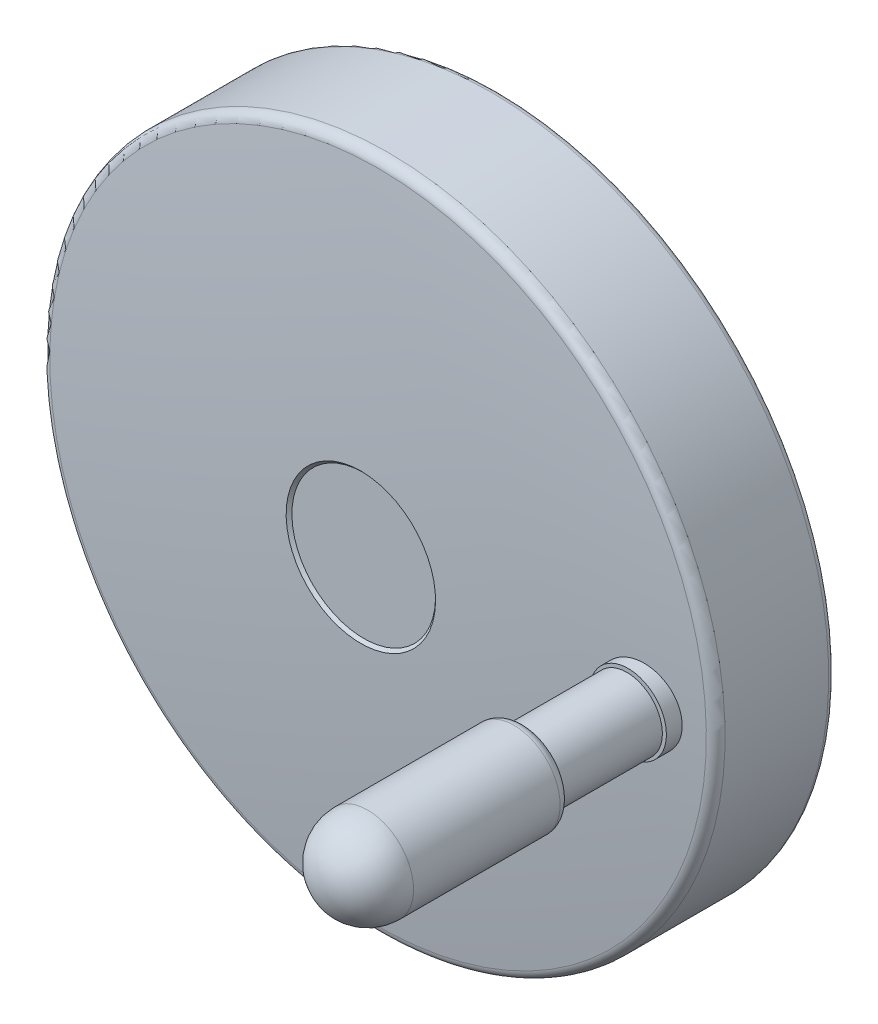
ISO-10303-21;
HEADER;
FILE_DESCRIPTION(('STEP AP214'),'2;1');
FILE_NAME('part.step','',(''),(''),'','','');
FILE_SCHEMA(('AUTOMOTIVE_DESIGN { 1 0 10303 214 1 1 1 1 }'));
ENDSEC;
DATA;
#1=APPLICATION_CONTEXT('core data for automotive mechanical design processes');
#2=APPLICATION_PROTOCOL_DEFINITION('international standard','automotive_design',2000,#1);
#3=PRODUCT_CONTEXT('',#1,'mechanical');
#4=PRODUCT('Part','Part','',(#3));
#5=PRODUCT_RELATED_PRODUCT_CATEGORY('part','',(#4));
#6=PRODUCT_DEFINITION_FORMATION('','',#4);
#7=PRODUCT_DEFINITION_CONTEXT('part definition',#1,'design');
#8=PRODUCT_DEFINITION('design','',#6,#7);
#9=PRODUCT_DEFINITION_SHAPE('','',#8);
#10=(LENGTH_UNIT() NAMED_UNIT(*) SI_UNIT(.MILLI.,.METRE.));
#11=(NAMED_UNIT(*) PLANE_ANGLE_UNIT() SI_UNIT($,.RADIAN.));
#12=(NAMED_UNIT(*) SI_UNIT($,.STERADIAN.) SOLID_ANGLE_UNIT());
#13=UNCERTAINTY_MEASURE_WITH_UNIT(LENGTH_MEASURE(1.E-05),#10,'distance_accuracy_value','');
#14=(GEOMETRIC_REPRESENTATION_CONTEXT(3) GLOBAL_UNCERTAINTY_ASSIGNED_CONTEXT((#13)) GLOBAL_UNIT_ASSIGNED_CONTEXT((#10,
#11,#12)) REPRESENTATION_CONTEXT('',''));
#15=CARTESIAN_POINT('',(0.,0.,0.));
#16=DIRECTION('',(0.,0.,1.));
#17=DIRECTION('',(1.,0.,0.));
#18=AXIS2_PLACEMENT_3D('',#15,#16,#17);
#19=CARTESIAN_POINT('',(70.,0.,117.));
#20=DIRECTION('',(0.,0.,1.));
#21=DIRECTION('',(0.,-1.,0.));
#22=AXIS2_PLACEMENT_3D('',#19,#20,#21);
#23=SPHERICAL_SURFACE('',#22,12.);
#24=CARTESIAN_POINT('',(70.,0.,129.));
#25=VERTEX_POINT('',#24);
#26=VERTEX_LOOP('',#25);
#27=FACE_BOUND('',#26,.T.);
#28=CARTESIAN_POINT('',(70.,0.,117.));
#29=DIRECTION('',(0.,0.,1.));
#30=DIRECTION('',(0.,1.,0.));
#31=AXIS2_PLACEMENT_3D('',#28,#29,#30);
#32=CIRCLE('',#31,12.);
#33=CARTESIAN_POINT('',(70.,12.,117.));
#34=VERTEX_POINT('',#33);
#35=EDGE_CURVE('E246',#34,#34,#32,.F.);
#36=ORIENTED_EDGE('',*,*,#35,.F.);
#37=EDGE_LOOP('',(#36));
#38=FACE_BOUND('',#37,.T.);
#39=ADVANCED_FACE('F14',(#27,#38),#23,.T.);
#40=CARTESIAN_POINT('',(70.,0.,97.875));
#41=DIRECTION('',(0.,0.,1.));
#42=DIRECTION('',(0.,1.,0.));
#43=AXIS2_PLACEMENT_3D('',#40,#41,#42);
#44=CYLINDRICAL_SURFACE('',#43,12.);
#45=ORIENTED_EDGE('',*,*,#35,.T.);
#46=EDGE_LOOP('',(#45));
#47=FACE_BOUND('',#46,.T.);
#48=CARTESIAN_POINT('',(70.,0.,78.75));
#49=DIRECTION('',(0.,0.,1.));
#50=DIRECTION('',(0.,1.,0.));
#51=AXIS2_PLACEMENT_3D('',#48,#49,#50);
#52=CIRCLE('',#51,12.);
#53=CARTESIAN_POINT('',(70.,12.,78.75));
#54=VERTEX_POINT('',#53);
#55=EDGE_CURVE('E26',#54,#54,#52,.T.);
#56=ORIENTED_EDGE('',*,*,#55,.T.);
#57=EDGE_LOOP('',(#56));
#58=FACE_BOUND('',#57,.T.);
#59=ADVANCED_FACE('F227',(#47,#58),#44,.T.);
#60=CARTESIAN_POINT('',(70.,0.,78.75));
#61=DIRECTION('',(0.,0.,-1.));
#62=DIRECTION('',(1.,0.,0.));
#63=AXIS2_PLACEMENT_3D('',#60,#61,#62);
#64=TOROIDAL_SURFACE('',#63,9.24999999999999,2.75);
#65=ORIENTED_EDGE('',*,*,#55,.F.);
#66=EDGE_LOOP('',(#65));
#67=FACE_BOUND('',#66,.T.);
#68=CARTESIAN_POINT('',(70.,0.,76.));
#69=DIRECTION('',(0.,0.,-1.));
#70=DIRECTION('',(1.,0.,0.));
#71=AXIS2_PLACEMENT_3D('',#68,#69,#70);
#72=CIRCLE('',#71,9.25);
#73=CARTESIAN_POINT('',(79.25,0.,76.));
#74=VERTEX_POINT('',#73);
#75=EDGE_CURVE('E249',#74,#74,#72,.F.);
#76=ORIENTED_EDGE('',*,*,#75,.T.);
#77=EDGE_LOOP('',(#76));
#78=FACE_BOUND('',#77,.T.);
#79=ADVANCED_FACE('F233',(#67,#78),#64,.T.);
#80=CARTESIAN_POINT('',(70.,0.,62.65));
#81=DIRECTION('',(0.,0.,1.));
#82=DIRECTION('',(0.,1.,0.));
#83=AXIS2_PLACEMENT_3D('',#80,#81,#82);
#84=CYLINDRICAL_SURFACE('',#83,9.25);
#85=CARTESIAN_POINT('',(70.,0.,49.3));
#86=DIRECTION('',(0.,0.,1.));
#87=DIRECTION('',(0.,1.,0.));
#88=AXIS2_PLACEMENT_3D('',#85,#86,#87);
#89=CIRCLE('',#88,9.25);
#90=CARTESIAN_POINT('',(70.,9.24999999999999,49.3));
#91=VERTEX_POINT('',#90);
#92=EDGE_CURVE('E254',#91,#91,#89,.T.);
#93=ORIENTED_EDGE('',*,*,#92,.T.);
#94=EDGE_LOOP('',(#93));
#95=FACE_BOUND('',#94,.T.);
#96=ORIENTED_EDGE('',*,*,#75,.F.);
#97=EDGE_LOOP('',(#96));
#98=FACE_BOUND('',#97,.T.);
#99=ADVANCED_FACE('F241',(#95,#98),#84,.T.);
#100=CARTESIAN_POINT('',(70.,-8.09375,49.3));
#101=DIRECTION('',(0.,0.,-1.));
#102=DIRECTION('',(0.,-1.,0.));
#103=AXIS2_PLACEMENT_3D('',#100,#101,#102);
#104=PLANE('',#103);
#105=ORIENTED_EDGE('',*,*,#92,.F.);
#106=EDGE_LOOP('',(#105));
#107=FACE_BOUND('',#106,.T.);
#108=CARTESIAN_POINT('',(70.,0.,49.3));
#109=DIRECTION('',(0.,0.,1.));
#110=DIRECTION('',(0.,1.,0.));
#111=AXIS2_PLACEMENT_3D('',#108,#109,#110);
#112=CIRCLE('',#111,6.9375);
#113=CARTESIAN_POINT('',(70.,6.93749999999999,49.3));
#114=VERTEX_POINT('',#113);
#115=EDGE_CURVE('E324',#114,#114,#112,.T.);
#116=ORIENTED_EDGE('',*,*,#115,.T.);
#117=EDGE_LOOP('',(#116));
#118=FACE_BOUND('',#117,.T.);
#119=ADVANCED_FACE('F590',(#107,#118),#104,.T.);
#120=CARTESIAN_POINT('',(70.,0.,49.15));
#121=DIRECTION('',(0.,0.,1.));
#122=DIRECTION('',(0.,1.,0.));
#123=AXIS2_PLACEMENT_3D('',#120,#121,#122);
#124=CYLINDRICAL_SURFACE('',#123,6.9375);
#125=CARTESIAN_POINT('',(70.,0.,49.));
#126=DIRECTION('',(0.,0.,1.));
#127=DIRECTION('',(0.,1.,0.));
#128=AXIS2_PLACEMENT_3D('',#125,#126,#127);
#129=CIRCLE('',#128,6.9375);
#130=CARTESIAN_POINT('',(70.,6.93749999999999,49.));
#131=VERTEX_POINT('',#130);
#132=EDGE_CURVE('E327',#131,#131,#129,.T.);
#133=ORIENTED_EDGE('',*,*,#132,.T.);
#134=EDGE_LOOP('',(#133));
#135=FACE_BOUND('',#134,.T.);
#136=ORIENTED_EDGE('',*,*,#115,.F.);
#137=EDGE_LOOP('',(#136));
#138=FACE_BOUND('',#137,.T.);
#139=ADVANCED_FACE('F346',(#135,#138),#124,.T.);
#140=CARTESIAN_POINT('',(70.,-5.08525,49.));
#141=DIRECTION('',(0.,0.,-1.));
#142=DIRECTION('',(0.,-1.,0.));
#143=AXIS2_PLACEMENT_3D('',#140,#141,#142);
#144=PLANE('',#143);
#145=CARTESIAN_POINT('',(70.,0.,49.));
#146=DIRECTION('',(0.,0.,1.));
#147=DIRECTION('',(0.,1.,0.));
#148=AXIS2_PLACEMENT_3D('',#145,#146,#147);
#149=CIRCLE('',#148,3.233);
#150=CARTESIAN_POINT('',(70.,3.23299999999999,49.));
#151=VERTEX_POINT('',#150);
#152=EDGE_CURVE('E260',#151,#151,#149,.T.);
#153=ORIENTED_EDGE('',*,*,#152,.T.);
#154=EDGE_LOOP('',(#153));
#155=FACE_BOUND('',#154,.T.);
#156=CARTESIAN_POINT('',(70.,0.,49.));
#157=DIRECTION('',(0.,0.,-1.));
#158=DIRECTION('',(0.,-1.,0.));
#159=AXIS2_PLACEMENT_3D('',#156,#157,#158);
#160=CIRCLE('',#159,5.00000000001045);
#161=CARTESIAN_POINT('',(70.,-5.00000000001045,49.));
#162=VERTEX_POINT('',#161);
#163=EDGE_CURVE('E9',#162,#162,#160,.T.);
#164=ORIENTED_EDGE('',*,*,#163,.T.);
#165=EDGE_LOOP('',(#164));
#166=FACE_BOUND('',#165,.T.);
#167=ADVANCED_FACE('F223',(#155,#166),#144,.T.);
#168=CARTESIAN_POINT('',(70.,0.,38.));
#169=DIRECTION('',(0.,0.,1.));
#170=DIRECTION('',(0.,1.,0.));
#171=AXIS2_PLACEMENT_3D('',#168,#169,#170);
#172=PLANE('',#171);
#173=DIRECTION('',(0.866025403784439,-0.5,0.));
#174=VECTOR('',#173,1.);
#175=CARTESIAN_POINT('',(70.,-2.30940107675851,38.));
#176=LINE('',#175,#174);
#177=CARTESIAN_POINT('',(70.,-2.30940107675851,38.));
#178=VERTEX_POINT('',#177);
#179=CARTESIAN_POINT('',(68.,-1.15470053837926,38.));
#180=VERTEX_POINT('',#179);
#181=EDGE_CURVE('E286',#178,#180,#176,.F.);
#182=ORIENTED_EDGE('',*,*,#181,.T.);
#183=DIRECTION('',(0.,-1.,0.));
#184=VECTOR('',#183,1.);
#185=CARTESIAN_POINT('',(68.,-1.15470053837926,38.));
#186=LINE('',#185,#184);
#187=CARTESIAN_POINT('',(68.,1.15470053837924,38.));
#188=VERTEX_POINT('',#187);
#189=EDGE_CURVE('E294',#180,#188,#186,.F.);
#190=ORIENTED_EDGE('',*,*,#189,.T.);
#191=DIRECTION('',(-0.866025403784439,-0.5,0.));
#192=VECTOR('',#191,1.);
#193=CARTESIAN_POINT('',(68.,1.15470053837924,38.));
#194=LINE('',#193,#192);
#195=CARTESIAN_POINT('',(70.,2.30940107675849,38.));
#196=VERTEX_POINT('',#195);
#197=EDGE_CURVE('E300',#188,#196,#194,.F.);
#198=ORIENTED_EDGE('',*,*,#197,.T.);
#199=DIRECTION('',(-0.866025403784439,0.5,0.));
#200=VECTOR('',#199,1.);
#201=CARTESIAN_POINT('',(70.,2.30940107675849,38.));
#202=LINE('',#201,#200);
#203=CARTESIAN_POINT('',(72.,1.15470053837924,38.));
#204=VERTEX_POINT('',#203);
#205=EDGE_CURVE('E306',#196,#204,#202,.F.);
#206=ORIENTED_EDGE('',*,*,#205,.T.);
#207=DIRECTION('',(0.,1.,0.));
#208=VECTOR('',#207,1.);
#209=CARTESIAN_POINT('',(72.,1.15470053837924,38.));
#210=LINE('',#209,#208);
#211=CARTESIAN_POINT('',(72.,-1.15470053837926,38.));
#212=VERTEX_POINT('',#211);
#213=EDGE_CURVE('E312',#204,#212,#210,.F.);
#214=ORIENTED_EDGE('',*,*,#213,.T.);
#215=DIRECTION('',(0.866025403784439,0.5,0.));
#216=VECTOR('',#215,1.);
#217=CARTESIAN_POINT('',(72.,-1.15470053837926,38.));
#218=LINE('',#217,#216);
#219=EDGE_CURVE('E318',#212,#178,#218,.F.);
#220=ORIENTED_EDGE('',*,*,#219,.T.);
#221=EDGE_LOOP('',(#182,#190,#198,#206,#214,#220));
#222=FACE_BOUND('',#221,.T.);
#223=ADVANCED_FACE('F347',(#222),#172,.F.);
#224=CARTESIAN_POINT('',(72.,-1.15470053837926,34.));
#225=DIRECTION('',(0.5,-0.866025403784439,0.));
#226=DIRECTION('',(0.866025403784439,0.5,0.));
#227=AXIS2_PLACEMENT_3D('',#224,#225,#226);
#228=PLANE('',#227);
#229=DIRECTION('',(0.,0.,1.));
#230=VECTOR('',#229,1.);
#231=CARTESIAN_POINT('',(72.,-1.15470053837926,34.));
#232=LINE('',#231,#230);
#233=CARTESIAN_POINT('',(72.,-1.15470053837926,34.));
#234=VERTEX_POINT('',#233);
#235=EDGE_CURVE('E315',#212,#234,#232,.F.);
#236=ORIENTED_EDGE('',*,*,#235,.T.);
#237=DIRECTION('',(0.866025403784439,0.5,0.));
#238=VECTOR('',#237,1.);
#239=CARTESIAN_POINT('',(70.,-2.30940107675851,34.));
#240=LINE('',#239,#238);
#241=CARTESIAN_POINT('',(70.,-2.30940107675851,34.));
#242=VERTEX_POINT('',#241);
#243=EDGE_CURVE('E283',#242,#234,#240,.T.);
#244=ORIENTED_EDGE('',*,*,#243,.F.);
#245=DIRECTION('',(0.,0.,1.));
#246=VECTOR('',#245,1.);
#247=CARTESIAN_POINT('',(70.,-2.30940107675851,34.));
#248=LINE('',#247,#246);
#249=EDGE_CURVE('E289',#242,#178,#248,.T.);
#250=ORIENTED_EDGE('',*,*,#249,.T.);
#251=ORIENTED_EDGE('',*,*,#219,.F.);
#252=EDGE_LOOP('',(#236,#244,#250,#251));
#253=FACE_BOUND('',#252,.T.);
#254=ADVANCED_FACE('F581',(#253),#228,.F.);
#255=CARTESIAN_POINT('',(72.,1.15470053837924,34.));
#256=DIRECTION('',(1.,0.,0.));
#257=DIRECTION('',(0.,1.,0.));
#258=AXIS2_PLACEMENT_3D('',#255,#256,#257);
#259=PLANE('',#258);
#260=DIRECTION('',(0.,0.,1.));
#261=VECTOR('',#260,1.);
#262=CARTESIAN_POINT('',(72.,1.15470053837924,34.));
#263=LINE('',#262,#261);
#264=CARTESIAN_POINT('',(72.,1.15470053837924,34.));
#265=VERTEX_POINT('',#264);
#266=EDGE_CURVE('E309',#204,#265,#263,.F.);
#267=ORIENTED_EDGE('',*,*,#266,.T.);
#268=DIRECTION('',(0.,-1.,0.));
#269=VECTOR('',#268,1.);
#270=CARTESIAN_POINT('',(72.,-1.6165,34.));
#271=LINE('',#270,#269);
#272=EDGE_CURVE('E280',#234,#265,#271,.F.);
#273=ORIENTED_EDGE('',*,*,#272,.F.);
#274=ORIENTED_EDGE('',*,*,#235,.F.);
#275=ORIENTED_EDGE('',*,*,#213,.F.);
#276=EDGE_LOOP('',(#267,#273,#274,#275));
#277=FACE_BOUND('',#276,.T.);
#278=ADVANCED_FACE('F683',(#277),#259,.F.);
#279=CARTESIAN_POINT('',(70.,2.30940107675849,34.));
#280=DIRECTION('',(0.5,0.866025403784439,0.));
#281=DIRECTION('',(-0.866025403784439,0.5,0.));
#282=AXIS2_PLACEMENT_3D('',#279,#280,#281);
#283=PLANE('',#282);
#284=DIRECTION('',(0.,0.,1.));
#285=VECTOR('',#284,1.);
#286=CARTESIAN_POINT('',(70.,2.30940107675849,34.));
#287=LINE('',#286,#285);
#288=CARTESIAN_POINT('',(70.,2.30940107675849,34.));
#289=VERTEX_POINT('',#288);
#290=EDGE_CURVE('E303',#196,#289,#287,.F.);
#291=ORIENTED_EDGE('',*,*,#290,.T.);
#292=DIRECTION('',(-0.866025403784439,0.5,0.));
#293=VECTOR('',#292,1.);
#294=CARTESIAN_POINT('',(72.,1.15470053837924,34.));
#295=LINE('',#294,#293);
#296=EDGE_CURVE('E277',#265,#289,#295,.T.);
#297=ORIENTED_EDGE('',*,*,#296,.F.);
#298=ORIENTED_EDGE('',*,*,#266,.F.);
#299=ORIENTED_EDGE('',*,*,#205,.F.);
#300=EDGE_LOOP('',(#291,#297,#298,#299));
#301=FACE_BOUND('',#300,.T.);
#302=ADVANCED_FACE('F673',(#301),#283,.F.);
#303=CARTESIAN_POINT('',(68.,1.15470053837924,34.));
#304=DIRECTION('',(-0.5,0.866025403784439,0.));
#305=DIRECTION('',(-0.866025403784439,-0.5,0.));
#306=AXIS2_PLACEMENT_3D('',#303,#304,#305);
#307=PLANE('',#306);
#308=DIRECTION('',(0.,0.,1.));
#309=VECTOR('',#308,1.);
#310=CARTESIAN_POINT('',(68.,1.15470053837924,34.));
#311=LINE('',#310,#309);
#312=CARTESIAN_POINT('',(68.,1.15470053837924,34.));
#313=VERTEX_POINT('',#312);
#314=EDGE_CURVE('E297',#188,#313,#311,.F.);
#315=ORIENTED_EDGE('',*,*,#314,.T.);
#316=DIRECTION('',(-0.866025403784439,-0.5,0.));
#317=VECTOR('',#316,1.);
#318=CARTESIAN_POINT('',(70.,2.30940107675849,34.));
#319=LINE('',#318,#317);
#320=EDGE_CURVE('E274',#289,#313,#319,.T.);
#321=ORIENTED_EDGE('',*,*,#320,.F.);
#322=ORIENTED_EDGE('',*,*,#290,.F.);
#323=ORIENTED_EDGE('',*,*,#197,.F.);
#324=EDGE_LOOP('',(#315,#321,#322,#323));
#325=FACE_BOUND('',#324,.T.);
#326=ADVANCED_FACE('F663',(#325),#307,.F.);
#327=CARTESIAN_POINT('',(68.,-1.15470053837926,34.));
#328=DIRECTION('',(-1.,0.,0.));
#329=DIRECTION('',(0.,-1.,0.));
#330=AXIS2_PLACEMENT_3D('',#327,#328,#329);
#331=PLANE('',#330);
#332=DIRECTION('',(0.,0.,1.));
#333=VECTOR('',#332,1.);
#334=CARTESIAN_POINT('',(68.,-1.15470053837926,34.));
#335=LINE('',#334,#333);
#336=CARTESIAN_POINT('',(68.,-1.15470053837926,34.));
#337=VERTEX_POINT('',#336);
#338=EDGE_CURVE('E292',#180,#337,#335,.F.);
#339=ORIENTED_EDGE('',*,*,#338,.T.);
#340=DIRECTION('',(0.,-1.,0.));
#341=VECTOR('',#340,1.);
#342=CARTESIAN_POINT('',(68.,-1.6165,34.));
#343=LINE('',#342,#341);
#344=EDGE_CURVE('E271',#313,#337,#343,.T.);
#345=ORIENTED_EDGE('',*,*,#344,.F.);
#346=ORIENTED_EDGE('',*,*,#314,.F.);
#347=ORIENTED_EDGE('',*,*,#189,.F.);
#348=EDGE_LOOP('',(#339,#345,#346,#347));
#349=FACE_BOUND('',#348,.T.);
#350=ADVANCED_FACE('F653',(#349),#331,.F.);
#351=CARTESIAN_POINT('',(70.,-2.30940107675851,34.));
#352=DIRECTION('',(-0.5,-0.866025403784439,0.));
#353=DIRECTION('',(0.866025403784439,-0.5,0.));
#354=AXIS2_PLACEMENT_3D('',#351,#352,#353);
#355=PLANE('',#354);
#356=ORIENTED_EDGE('',*,*,#249,.F.);
#357=DIRECTION('',(0.866025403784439,-0.5,0.));
#358=VECTOR('',#357,1.);
#359=CARTESIAN_POINT('',(68.,-1.15470053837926,34.));
#360=LINE('',#359,#358);
#361=EDGE_CURVE('E268',#337,#242,#360,.T.);
#362=ORIENTED_EDGE('',*,*,#361,.F.);
#363=ORIENTED_EDGE('',*,*,#338,.F.);
#364=ORIENTED_EDGE('',*,*,#181,.F.);
#365=EDGE_LOOP('',(#356,#362,#363,#364));
#366=FACE_BOUND('',#365,.T.);
#367=ADVANCED_FACE('F643',(#366),#355,.F.);
#368=CARTESIAN_POINT('',(70.,-1.6165,34.));
#369=DIRECTION('',(0.,0.,-1.));
#370=DIRECTION('',(0.,-1.,0.));
#371=AXIS2_PLACEMENT_3D('',#368,#369,#370);
#372=PLANE('',#371);
#373=CARTESIAN_POINT('',(70.,0.,33.9999999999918));
#374=DIRECTION('',(0.,0.,1.));
#375=DIRECTION('',(0.,1.,0.));
#376=AXIS2_PLACEMENT_3D('',#373,#374,#375);
#377=CIRCLE('',#376,3.23299999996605);
#378=CARTESIAN_POINT('',(70.,3.23299999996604,33.9999999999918));
#379=VERTEX_POINT('',#378);
#380=EDGE_CURVE('E267',#379,#379,#377,.T.);
#381=ORIENTED_EDGE('',*,*,#380,.F.);
#382=EDGE_LOOP('',(#381));
#383=FACE_BOUND('',#382,.T.);
#384=ORIENTED_EDGE('',*,*,#344,.T.);
#385=ORIENTED_EDGE('',*,*,#361,.T.);
#386=ORIENTED_EDGE('',*,*,#243,.T.);
#387=ORIENTED_EDGE('',*,*,#272,.T.);
#388=ORIENTED_EDGE('',*,*,#296,.T.);
#389=ORIENTED_EDGE('',*,*,#320,.T.);
#390=EDGE_LOOP('',(#384,#385,#386,#387,#388,#389));
#391=FACE_BOUND('',#390,.T.);
#392=ADVANCED_FACE('F633',(#383,#391),#372,.T.);
#393=CARTESIAN_POINT('',(70.,0.,34.766999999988));
#394=DIRECTION('',(0.,0.,1.));
#395=DIRECTION('',(0.,1.,0.));
#396=AXIS2_PLACEMENT_3D('',#393,#394,#395);
#397=CONICAL_SURFACE('',#396,3.99999999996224,0.785398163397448);
#398=ORIENTED_EDGE('',*,*,#380,.T.);
#399=EDGE_LOOP('',(#398));
#400=FACE_BOUND('',#399,.T.);
#401=CARTESIAN_POINT('',(70.,0.,34.767));
#402=DIRECTION('',(0.,0.,1.));
#403=DIRECTION('',(0.,1.,0.));
#404=AXIS2_PLACEMENT_3D('',#401,#402,#403);
#405=CIRCLE('',#404,4.);
#406=CARTESIAN_POINT('',(70.,3.99999999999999,34.767));
#407=VERTEX_POINT('',#406);
#408=EDGE_CURVE('E264',#407,#407,#405,.T.);
#409=ORIENTED_EDGE('',*,*,#408,.F.);
#410=EDGE_LOOP('',(#409));
#411=FACE_BOUND('',#410,.T.);
#412=ADVANCED_FACE('F623',(#400,#411),#397,.T.);
#413=CARTESIAN_POINT('',(70.,0.,40.75));
#414=DIRECTION('',(0.,0.,1.));
#415=DIRECTION('',(0.,1.,0.));
#416=AXIS2_PLACEMENT_3D('',#413,#414,#415);
#417=CYLINDRICAL_SURFACE('',#416,4.);
#418=ORIENTED_EDGE('',*,*,#408,.T.);
#419=EDGE_LOOP('',(#418));
#420=FACE_BOUND('',#419,.T.);
#421=CARTESIAN_POINT('',(70.,0.,46.7330000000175));
#422=DIRECTION('',(0.,0.,-1.));
#423=DIRECTION('',(0.,-1.,0.));
#424=AXIS2_PLACEMENT_3D('',#421,#422,#423);
#425=CIRCLE('',#424,4.00000000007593);
#426=CARTESIAN_POINT('',(70.,-4.00000000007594,46.7330000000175));
#427=VERTEX_POINT('',#426);
#428=EDGE_CURVE('E261',#427,#427,#425,.F.);
#429=ORIENTED_EDGE('',*,*,#428,.F.);
#430=EDGE_LOOP('',(#429));
#431=FACE_BOUND('',#430,.T.);
#432=ADVANCED_FACE('F613',(#420,#431),#417,.T.);
#433=CARTESIAN_POINT('',(70.,0.,46.7330000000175));
#434=DIRECTION('',(0.,0.,-1.));
#435=DIRECTION('',(0.,-1.,0.));
#436=AXIS2_PLACEMENT_3D('',#433,#434,#435);
#437=CONICAL_SURFACE('',#436,4.00000000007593,0.785398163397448);
#438=ORIENTED_EDGE('',*,*,#428,.T.);
#439=EDGE_LOOP('',(#438));
#440=FACE_BOUND('',#439,.T.);
#441=CARTESIAN_POINT('',(70.,0.,47.5));
#442=DIRECTION('',(0.,0.,1.));
#443=DIRECTION('',(0.,1.,0.));
#444=AXIS2_PLACEMENT_3D('',#441,#442,#443);
#445=CIRCLE('',#444,3.233);
#446=CARTESIAN_POINT('',(70.,3.23299999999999,47.5));
#447=VERTEX_POINT('',#446);
#448=EDGE_CURVE('E257',#447,#447,#445,.T.);
#449=ORIENTED_EDGE('',*,*,#448,.F.);
#450=EDGE_LOOP('',(#449));
#451=FACE_BOUND('',#450,.T.);
#452=ADVANCED_FACE('F602',(#440,#451),#437,.T.);
#453=CARTESIAN_POINT('',(70.,0.,48.25));
#454=DIRECTION('',(0.,0.,1.));
#455=DIRECTION('',(0.,1.,0.));
#456=AXIS2_PLACEMENT_3D('',#453,#454,#455);
#457=CYLINDRICAL_SURFACE('',#456,3.233);
#458=ORIENTED_EDGE('',*,*,#448,.T.);
#459=EDGE_LOOP('',(#458));
#460=FACE_BOUND('',#459,.T.);
#461=ORIENTED_EDGE('',*,*,#152,.F.);
#462=EDGE_LOOP('',(#461));
#463=FACE_BOUND('',#462,.T.);
#464=ADVANCED_FACE('F221',(#460,#463),#457,.T.);
#465=CARTESIAN_POINT('',(-8.25,0.,30.8));
#466=DIRECTION('',(0.,0.,-1.));
#467=DIRECTION('',(-1.,0.,0.));
#468=AXIS2_PLACEMENT_3D('',#465,#466,#467);
#469=PLANE('',#468);
#470=CARTESIAN_POINT('',(0.,0.,30.8));
#471=DIRECTION('',(0.,0.,-1.));
#472=DIRECTION('',(0.,-1.,0.));
#473=AXIS2_PLACEMENT_3D('',#470,#471,#472);
#474=CIRCLE('',#473,16.5);
#475=CARTESIAN_POINT('',(0.,-16.5,30.8));
#476=VERTEX_POINT('',#475);
#477=EDGE_CURVE('E434',#476,#476,#474,.T.);
#478=ORIENTED_EDGE('',*,*,#477,.T.);
#479=EDGE_LOOP('',(#478));
#480=FACE_BOUND('',#479,.T.);
#481=ADVANCED_FACE('F16',(#480),#469,.T.);
#482=CARTESIAN_POINT('',(0.,0.,29.4));
#483=DIRECTION('',(0.,0.,-1.));
#484=DIRECTION('',(0.,-1.,0.));
#485=AXIS2_PLACEMENT_3D('',#482,#483,#484);
#486=CYLINDRICAL_SURFACE('',#485,16.5);
#487=CARTESIAN_POINT('',(0.,0.,28.));
#488=DIRECTION('',(0.,0.,-1.));
#489=DIRECTION('',(0.,-1.,0.));
#490=AXIS2_PLACEMENT_3D('',#487,#488,#489);
#491=CIRCLE('',#490,16.5);
#492=CARTESIAN_POINT('',(0.,-16.5,28.));
#493=VERTEX_POINT('',#492);
#494=EDGE_CURVE('E431',#493,#493,#491,.F.);
#495=ORIENTED_EDGE('',*,*,#494,.F.);
#496=EDGE_LOOP('',(#495));
#497=FACE_BOUND('',#496,.T.);
#498=ORIENTED_EDGE('',*,*,#477,.F.);
#499=EDGE_LOOP('',(#498));
#500=FACE_BOUND('',#499,.T.);
#501=ADVANCED_FACE('F212',(#497,#500),#486,.F.);
#502=CARTESIAN_POINT('',(-12.5166666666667,0.,28.));
#503=DIRECTION('',(0.,0.,1.));
#504=DIRECTION('',(0.,1.,0.));
#505=AXIS2_PLACEMENT_3D('',#502,#503,#504);
#506=PLANE('',#505);
#507=ORIENTED_EDGE('',*,*,#494,.T.);
#508=EDGE_LOOP('',(#507));
#509=FACE_BOUND('',#508,.T.);
#510=CARTESIAN_POINT('',(0.,0.,28.));
#511=DIRECTION('',(0.,0.,1.));
#512=DIRECTION('',(0.,1.,0.));
#513=AXIS2_PLACEMENT_3D('',#510,#511,#512);
#514=CIRCLE('',#513,8.53333333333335);
#515=CARTESIAN_POINT('',(0.,8.53333333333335,28.));
#516=VERTEX_POINT('',#515);
#517=EDGE_CURVE('E427',#516,#516,#514,.F.);
#518=ORIENTED_EDGE('',*,*,#517,.T.);
#519=EDGE_LOOP('',(#518));
#520=FACE_BOUND('',#519,.T.);
#521=ADVANCED_FACE('F209',(#509,#520),#506,.T.);
#522=CARTESIAN_POINT('',(0.,0.,28.));
#523=DIRECTION('',(0.,0.,1.));
#524=DIRECTION('',(0.,1.,0.));
#525=AXIS2_PLACEMENT_3D('',#522,#523,#524);
#526=CONICAL_SURFACE('',#525,8.53333333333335,0.785398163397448);
#527=CARTESIAN_POINT('',(0.,0.,27.4666666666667));
#528=DIRECTION('',(0.,0.,-1.));
#529=DIRECTION('',(0.,-1.,0.));
#530=AXIS2_PLACEMENT_3D('',#527,#528,#529);
#531=CIRCLE('',#530,8.);
#532=CARTESIAN_POINT('',(0.,-8.,27.4666666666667));
#533=VERTEX_POINT('',#532);
#534=EDGE_CURVE('E430',#533,#533,#531,.T.);
#535=ORIENTED_EDGE('',*,*,#534,.T.);
#536=EDGE_LOOP('',(#535));
#537=FACE_BOUND('',#536,.T.);
#538=ORIENTED_EDGE('',*,*,#517,.F.);
#539=EDGE_LOOP('',(#538));
#540=FACE_BOUND('',#539,.T.);
#541=ADVANCED_FACE('F205',(#537,#540),#526,.F.);
#542=CARTESIAN_POINT('',(0.,0.,14.));
#543=DIRECTION('',(0.,0.,-1.));
#544=DIRECTION('',(0.,-1.,0.));
#545=AXIS2_PLACEMENT_3D('',#542,#543,#544);
#546=CYLINDRICAL_SURFACE('',#545,8.);
#547=CARTESIAN_POINT('',(0.,0.,0.533333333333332));
#548=DIRECTION('',(0.,0.,-1.));
#549=DIRECTION('',(-1.,0.,0.));
#550=AXIS2_PLACEMENT_3D('',#547,#548,#549);
#551=CIRCLE('',#550,8.);
#552=CARTESIAN_POINT('',(-8.,0.,0.533333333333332));
#553=VERTEX_POINT('',#552);
#554=EDGE_CURVE('E426',#553,#553,#551,.T.);
#555=ORIENTED_EDGE('',*,*,#554,.T.);
#556=EDGE_LOOP('',(#555));
#557=FACE_BOUND('',#556,.T.);
#558=ORIENTED_EDGE('',*,*,#534,.F.);
#559=EDGE_LOOP('',(#558));
#560=FACE_BOUND('',#559,.T.);
#561=ADVANCED_FACE('F201',(#557,#560),#546,.F.);
#562=CARTESIAN_POINT('',(0.,0.,0.));
#563=DIRECTION('',(0.,0.,-1.));
#564=DIRECTION('',(0.,-1.,0.));
#565=AXIS2_PLACEMENT_3D('',#562,#563,#564);
#566=CONICAL_SURFACE('',#565,8.53333333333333,0.78539816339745);
#567=CARTESIAN_POINT('',(0.,0.,0.));
#568=DIRECTION('',(0.,0.,-1.));
#569=DIRECTION('',(0.,-1.,0.));
#570=AXIS2_PLACEMENT_3D('',#567,#568,#569);
#571=CIRCLE('',#570,8.53333333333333);
#572=CARTESIAN_POINT('',(0.,-8.53333333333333,0.));
#573=VERTEX_POINT('',#572);
#574=EDGE_CURVE('E423',#573,#573,#571,.F.);
#575=ORIENTED_EDGE('',*,*,#574,.F.);
#576=EDGE_LOOP('',(#575));
#577=FACE_BOUND('',#576,.T.);
#578=ORIENTED_EDGE('',*,*,#554,.F.);
#579=EDGE_LOOP('',(#578));
#580=FACE_BOUND('',#579,.T.);
#581=ADVANCED_FACE('F197',(#577,#580),#566,.F.);
#582=CARTESIAN_POINT('',(-13.0166666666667,0.,0.));
#583=DIRECTION('',(0.,0.,-1.));
#584=DIRECTION('',(0.,-1.,0.));
#585=AXIS2_PLACEMENT_3D('',#582,#583,#584);
#586=PLANE('',#585);
#587=ORIENTED_EDGE('',*,*,#574,.T.);
#588=EDGE_LOOP('',(#587));
#589=FACE_BOUND('',#588,.T.);
#590=CARTESIAN_POINT('',(0.,0.,0.));
#591=DIRECTION('',(0.,0.,-1.));
#592=DIRECTION('',(0.,-1.,0.));
#593=AXIS2_PLACEMENT_3D('',#590,#591,#592);
#594=CIRCLE('',#593,17.5);
#595=CARTESIAN_POINT('',(0.,-17.5,0.));
#596=VERTEX_POINT('',#595);
#597=EDGE_CURVE('E420',#596,#596,#594,.F.);
#598=ORIENTED_EDGE('',*,*,#597,.F.);
#599=EDGE_LOOP('',(#598));
#600=FACE_BOUND('',#599,.T.);
#601=ADVANCED_FACE('F193',(#589,#600),#586,.T.);
#602=CARTESIAN_POINT('',(0.,0.,0.1));
#603=DIRECTION('',(0.,0.,-1.));
#604=DIRECTION('',(0.,-1.,0.));
#605=AXIS2_PLACEMENT_3D('',#602,#603,#604);
#606=CYLINDRICAL_SURFACE('',#605,17.5);
#607=CARTESIAN_POINT('',(0.,0.,0.2));
#608=DIRECTION('',(0.,0.,-1.));
#609=DIRECTION('',(0.,-1.,0.));
#610=AXIS2_PLACEMENT_3D('',#607,#608,#609);
#611=CIRCLE('',#610,17.5);
#612=CARTESIAN_POINT('',(0.,-17.5,0.2));
#613=VERTEX_POINT('',#612);
#614=EDGE_CURVE('E417',#613,#613,#611,.F.);
#615=ORIENTED_EDGE('',*,*,#614,.F.);
#616=EDGE_LOOP('',(#615));
#617=FACE_BOUND('',#616,.T.);
#618=ORIENTED_EDGE('',*,*,#597,.T.);
#619=EDGE_LOOP('',(#618));
#620=FACE_BOUND('',#619,.T.);
#621=ADVANCED_FACE('F189',(#617,#620),#606,.T.);
#622=CARTESIAN_POINT('',(-19.75,0.,0.2));
#623=DIRECTION('',(0.,0.,-1.));
#624=DIRECTION('',(-1.,0.,0.));
#625=AXIS2_PLACEMENT_3D('',#622,#623,#624);
#626=PLANE('',#625);
#627=ORIENTED_EDGE('',*,*,#614,.T.);
#628=EDGE_LOOP('',(#627));
#629=FACE_BOUND('',#628,.T.);
#630=CARTESIAN_POINT('',(0.,0.,0.2));
#631=DIRECTION('',(0.,0.,-1.));
#632=DIRECTION('',(0.,-1.,0.));
#633=AXIS2_PLACEMENT_3D('',#630,#631,#632);
#634=CIRCLE('',#633,22.);
#635=CARTESIAN_POINT('',(0.,-22.,0.2));
#636=VERTEX_POINT('',#635);
#637=EDGE_CURVE('E414',#636,#636,#634,.F.);
#638=ORIENTED_EDGE('',*,*,#637,.F.);
#639=EDGE_LOOP('',(#638));
#640=FACE_BOUND('',#639,.T.);
#641=ADVANCED_FACE('F185',(#629,#640),#626,.T.);
#642=CARTESIAN_POINT('',(0.,0.,14.5934787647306));
#643=DIRECTION('',(0.,0.,-1.));
#644=DIRECTION('',(0.,-1.,0.));
#645=AXIS2_PLACEMENT_3D('',#642,#643,#644);
#646=CYLINDRICAL_SURFACE('',#645,22.);
#647=ORIENTED_EDGE('',*,*,#637,.T.);
#648=EDGE_LOOP('',(#647));
#649=FACE_BOUND('',#648,.T.);
#650=CARTESIAN_POINT('',(0.,0.,28.9869575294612));
#651=DIRECTION('',(0.,0.,1.));
#652=DIRECTION('',(0.,1.,0.));
#653=AXIS2_PLACEMENT_3D('',#650,#651,#652);
#654=CIRCLE('',#653,22.);
#655=CARTESIAN_POINT('',(0.,22.,28.9869575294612));
#656=VERTEX_POINT('',#655);
#657=EDGE_CURVE('E174',#656,#656,#654,.F.);
#658=ORIENTED_EDGE('',*,*,#657,.T.);
#659=EDGE_LOOP('',(#658));
#660=FACE_BOUND('',#659,.T.);
#661=ADVANCED_FACE('F181',(#649,#660),#646,.T.);
#662=CARTESIAN_POINT('',(0.,0.,28.9869575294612));
#663=DIRECTION('',(0.,0.,1.));
#664=DIRECTION('',(0.,1.,0.));
#665=AXIS2_PLACEMENT_3D('',#662,#663,#664);
#666=TOROIDAL_SURFACE('',#665,23.3,1.3);
#667=ORIENTED_EDGE('',*,*,#657,.F.);
#668=EDGE_LOOP('',(#667));
#669=FACE_BOUND('',#668,.T.);
#670=CARTESIAN_POINT('',(0.,0.,30.267207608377));
#671=DIRECTION('',(0.,0.,1.));
#672=DIRECTION('',(-1.,0.,0.));
#673=AXIS2_PLACEMENT_3D('',#670,#671,#672);
#674=CIRCLE('',#673,23.074257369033);
#675=CARTESIAN_POINT('',(-23.074257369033,0.,30.267207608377));
#676=VERTEX_POINT('',#675);
#677=EDGE_CURVE('E171',#676,#676,#674,.T.);
#678=ORIENTED_EDGE('',*,*,#677,.F.);
#679=EDGE_LOOP('',(#678));
#680=FACE_BOUND('',#679,.T.);
#681=ADVANCED_FACE('F178',(#669,#680),#666,.F.);
#682=CARTESIAN_POINT('',(0.,0.,36.3016173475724));
#683=DIRECTION('',(0.,0.,1.));
#684=DIRECTION('',(0.,1.,0.));
#685=AXIS2_PLACEMENT_3D('',#682,#683,#684);
#686=CONICAL_SURFACE('',#685,57.297095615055,1.39626340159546);
#687=ORIENTED_EDGE('',*,*,#677,.T.);
#688=EDGE_LOOP('',(#687));
#689=FACE_BOUND('',#688,.T.);
#690=CARTESIAN_POINT('',(0.,0.,36.3016173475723));
#691=DIRECTION('',(0.,0.,1.));
#692=DIRECTION('',(0.,1.,0.));
#693=AXIS2_PLACEMENT_3D('',#690,#691,#692);
#694=CIRCLE('',#693,57.297095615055);
#695=CARTESIAN_POINT('',(0.,57.297095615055,36.3016173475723));
#696=VERTEX_POINT('',#695);
#697=EDGE_CURVE('E168',#696,#696,#694,.F.);
#698=ORIENTED_EDGE('',*,*,#697,.T.);
#699=EDGE_LOOP('',(#698));
#700=FACE_BOUND('',#699,.T.);
#701=ADVANCED_FACE('F128',(#689,#700),#686,.T.);
#702=CARTESIAN_POINT('',(0.,0.,19.6));
#703=DIRECTION('',(0.,0.,-1.));
#704=DIRECTION('',(0.,-1.,0.));
#705=AXIS2_PLACEMENT_3D('',#702,#703,#704);
#706=CONICAL_SURFACE('',#705,84.48,0.087266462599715);
#707=CARTESIAN_POINT('',(0.,0.,19.6));
#708=DIRECTION('',(0.,0.,-1.));
#709=DIRECTION('',(0.,-1.,0.));
#710=AXIS2_PLACEMENT_3D('',#707,#708,#709);
#711=CIRCLE('',#710,84.48);
#712=CARTESIAN_POINT('',(0.,-84.48,19.6));
#713=VERTEX_POINT('',#712);
#714=EDGE_CURVE('E398',#713,#713,#711,.T.);
#715=ORIENTED_EDGE('',*,*,#714,.T.);
#716=EDGE_LOOP('',(#715));
#717=FACE_BOUND('',#716,.T.);
#718=CARTESIAN_POINT('',(0.,0.,34.3));
#719=DIRECTION('',(0.,0.,-1.));
#720=DIRECTION('',(-1.,0.,0.));
#721=AXIS2_PLACEMENT_3D('',#718,#719,#720);
#722=CIRCLE('',#721,83.193916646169);
#723=CARTESIAN_POINT('',(-83.193916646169,0.,34.3));
#724=VERTEX_POINT('',#723);
#725=EDGE_CURVE('E399',#724,#724,#722,.T.);
#726=ORIENTED_EDGE('',*,*,#725,.F.);
#727=EDGE_LOOP('',(#726));
#728=FACE_BOUND('',#727,.T.);
#729=ADVANCED_FACE('F120',(#717,#728),#706,.F.);
#730=CARTESIAN_POINT('',(0.,0.,16.3));
#731=DIRECTION('',(0.,0.,-1.));
#732=DIRECTION('',(0.,-1.,0.));
#733=AXIS2_PLACEMENT_3D('',#730,#731,#732);
#734=CYLINDRICAL_SURFACE('',#733,84.48);
#735=CARTESIAN_POINT('',(0.,0.,13.));
#736=DIRECTION('',(0.,0.,-1.));
#737=DIRECTION('',(0.,-1.,0.));
#738=AXIS2_PLACEMENT_3D('',#735,#736,#737);
#739=CIRCLE('',#738,84.48);
#740=CARTESIAN_POINT('',(0.,-84.48,13.));
#741=VERTEX_POINT('',#740);
#742=EDGE_CURVE('E391',#741,#741,#739,.F.);
#743=ORIENTED_EDGE('',*,*,#742,.F.);
#744=EDGE_LOOP('',(#743));
#745=FACE_BOUND('',#744,.T.);
#746=ORIENTED_EDGE('',*,*,#714,.F.);
#747=EDGE_LOOP('',(#746));
#748=FACE_BOUND('',#747,.T.);
#749=ADVANCED_FACE('F102',(#745,#748),#734,.F.);
#750=CARTESIAN_POINT('',(-85.4275,0.,13.));
#751=DIRECTION('',(0.,0.,-1.));
#752=DIRECTION('',(-1.,0.,0.));
#753=AXIS2_PLACEMENT_3D('',#750,#751,#752);
#754=PLANE('',#753);
#755=ORIENTED_EDGE('',*,*,#742,.T.);
#756=EDGE_LOOP('',(#755));
#757=FACE_BOUND('',#756,.T.);
#758=CARTESIAN_POINT('',(0.,0.,13.));
#759=DIRECTION('',(0.,0.,1.));
#760=DIRECTION('',(0.,1.,0.));
#761=AXIS2_PLACEMENT_3D('',#758,#759,#760);
#762=CIRCLE('',#761,86.375);
#763=CARTESIAN_POINT('',(0.,86.375,12.9999999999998));
#764=VERTEX_POINT('',#763);
#765=CARTESIAN_POINT('',(-86.375,0.,13.));
#766=VERTEX_POINT('',#765);
#767=EDGE_CURVE('E49',#764,#766,#762,.T.);
#768=ORIENTED_EDGE('',*,*,#767,.F.);
#769=CARTESIAN_POINT('',(0.,0.,13.));
#770=DIRECTION('',(0.,0.,1.));
#771=DIRECTION('',(0.,-1.,0.));
#772=AXIS2_PLACEMENT_3D('',#769,#770,#771);
#773=CIRCLE('',#772,86.375);
#774=CARTESIAN_POINT('',(0.,-86.375,12.9999999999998));
#775=VERTEX_POINT('',#774);
#776=EDGE_CURVE('E53',#775,#764,#773,.T.);
#777=ORIENTED_EDGE('',*,*,#776,.F.);
#778=CARTESIAN_POINT('',(0.,0.,13.));
#779=DIRECTION('',(0.,0.,1.));
#780=DIRECTION('',(-1.,0.,0.));
#781=AXIS2_PLACEMENT_3D('',#778,#779,#780);
#782=CIRCLE('',#781,86.375);
#783=EDGE_CURVE('E46',#766,#775,#782,.T.);
#784=ORIENTED_EDGE('',*,*,#783,.F.);
#785=EDGE_LOOP('',(#768,#777,#784));
#786=FACE_BOUND('',#785,.T.);
#787=ADVANCED_FACE('F52',(#757,#786),#754,.T.);
#788=CARTESIAN_POINT('',(0.,0.,14.625));
#789=DIRECTION('',(0.,0.,1.));
#790=DIRECTION('',(0.,1.,0.));
#791=AXIS2_PLACEMENT_3D('',#788,#789,#790);
#792=TOROIDAL_SURFACE('',#791,86.375,1.625);
#793=CARTESIAN_POINT('',(0.,0.,14.625));
#794=DIRECTION('',(0.,0.,-1.));
#795=DIRECTION('',(0.,-1.,0.));
#796=AXIS2_PLACEMENT_3D('',#793,#794,#795);
#797=CIRCLE('',#796,88.);
#798=CARTESIAN_POINT('',(0.,-88.,14.625));
#799=VERTEX_POINT('',#798);
#800=EDGE_CURVE('E62',#799,#799,#797,.F.);
#801=ORIENTED_EDGE('',*,*,#800,.F.);
#802=EDGE_LOOP('',(#801));
#803=FACE_BOUND('',#802,.T.);
#804=ORIENTED_EDGE('',*,*,#776,.T.);
#805=ORIENTED_EDGE('',*,*,#767,.T.);
#806=ORIENTED_EDGE('',*,*,#783,.T.);
#807=EDGE_LOOP('',(#804,#805,#806));
#808=FACE_BOUND('',#807,.T.);
#809=ADVANCED_FACE('F61',(#803,#808),#792,.T.);
#810=CARTESIAN_POINT('',(-9.37238058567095,0.,48.));
#811=DIRECTION('',(0.,0.,1.));
#812=DIRECTION('',(0.,1.,0.));
#813=AXIS2_PLACEMENT_3D('',#810,#811,#812);
#814=PLANE('',#813);
#815=CARTESIAN_POINT('',(0.,0.,48.));
#816=DIRECTION('',(0.,0.,1.));
#817=DIRECTION('',(0.,1.,0.));
#818=AXIS2_PLACEMENT_3D('',#815,#816,#817);
#819=CIRCLE('',#818,18.7447611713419);
#820=CARTESIAN_POINT('',(0.,18.7447611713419,48.));
#821=VERTEX_POINT('',#820);
#822=EDGE_CURVE('E362',#821,#821,#819,.T.);
#823=ORIENTED_EDGE('',*,*,#822,.T.);
#824=EDGE_LOOP('',(#823));
#825=FACE_BOUND('',#824,.T.);
#826=ADVANCED_FACE('F82',(#825),#814,.T.);
#827=CARTESIAN_POINT('',(0.,0.,28.1505358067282));
#828=DIRECTION('',(0.,0.,-1.));
#829=DIRECTION('',(0.,-1.,0.));
#830=AXIS2_PLACEMENT_3D('',#827,#828,#829);
#831=CYLINDRICAL_SURFACE('',#830,88.);
#832=ORIENTED_EDGE('',*,*,#800,.T.);
#833=EDGE_LOOP('',(#832));
#834=FACE_BOUND('',#833,.T.);
#835=CARTESIAN_POINT('',(0.,0.,41.6760716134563));
#836=DIRECTION('',(0.,0.,1.));
#837=DIRECTION('',(0.,1.,0.));
#838=AXIS2_PLACEMENT_3D('',#835,#836,#837);
#839=CIRCLE('',#838,88.);
#840=CARTESIAN_POINT('',(0.,88.,41.6760716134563));
#841=VERTEX_POINT('',#840);
#842=EDGE_CURVE('E360',#841,#841,#839,.T.);
#843=ORIENTED_EDGE('',*,*,#842,.F.);
#844=EDGE_LOOP('',(#843));
#845=FACE_BOUND('',#844,.T.);
#846=ADVANCED_FACE('F368',(#834,#845),#831,.T.);
#847=CARTESIAN_POINT('',(0.,0.,48.7552388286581));
#848=DIRECTION('',(0.,0.,1.));
#849=DIRECTION('',(0.,1.,0.));
#850=AXIS2_PLACEMENT_3D('',#847,#848,#849);
#851=CONICAL_SURFACE('',#850,19.5,0.785398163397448);
#852=ORIENTED_EDGE('',*,*,#822,.F.);
#853=EDGE_LOOP('',(#852));
#854=FACE_BOUND('',#853,.T.);
#855=CARTESIAN_POINT('',(0.,0.,48.7552388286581));
#856=DIRECTION('',(0.,0.,1.));
#857=DIRECTION('',(0.,1.,0.));
#858=AXIS2_PLACEMENT_3D('',#855,#856,#857);
#859=CIRCLE('',#858,19.5);
#860=CARTESIAN_POINT('',(0.,19.5,48.7552388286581));
#861=VERTEX_POINT('',#860);
#862=EDGE_CURVE('E359',#861,#861,#859,.F.);
#863=ORIENTED_EDGE('',*,*,#862,.F.);
#864=EDGE_LOOP('',(#863));
#865=FACE_BOUND('',#864,.T.);
#866=ADVANCED_FACE('F369',(#854,#865),#851,.F.);
#867=CARTESIAN_POINT('',(0.,0.,41.6760716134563));
#868=DIRECTION('',(0.,0.,1.));
#869=DIRECTION('',(0.,1.,0.));
#870=AXIS2_PLACEMENT_3D('',#867,#868,#869);
#871=TOROIDAL_SURFACE('',#870,85.4,2.60000000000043);
#872=ORIENTED_EDGE('',*,*,#842,.T.);
#873=EDGE_LOOP('',(#872));
#874=FACE_BOUND('',#873,.T.);
#875=CARTESIAN_POINT('',(0.,0.,44.2602092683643));
#876=DIRECTION('',(0.,0.,1.));
#877=DIRECTION('',(0.,1.,0.));
#878=AXIS2_PLACEMENT_3D('',#875,#876,#877);
#879=CIRCLE('',#878,85.6867622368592);
#880=CARTESIAN_POINT('',(0.,85.6867622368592,44.2602092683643));
#881=VERTEX_POINT('',#880);
#882=EDGE_CURVE('E321',#881,#881,#879,.T.);
#883=ORIENTED_EDGE('',*,*,#882,.F.);
#884=EDGE_LOOP('',(#883));
#885=FACE_BOUND('',#884,.T.);
#886=ADVANCED_FACE('F344',(#874,#885),#871,.T.);
#887=CARTESIAN_POINT('',(0.,0.,-727.900000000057));
#888=DIRECTION('',(-1.,0.,0.));
#889=DIRECTION('',(0.,0.,1.));
#890=AXIS2_PLACEMENT_3D('',#887,#888,#889);
#891=SPHERICAL_SURFACE('',#890,776.900000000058);
#892=ORIENTED_EDGE('',*,*,#882,.T.);
#893=EDGE_LOOP('',(#892));
#894=FACE_BOUND('',#893,.T.);
#895=ORIENTED_EDGE('',*,*,#862,.T.);
#896=EDGE_LOOP('',(#895));
#897=FACE_BOUND('',#896,.T.);
#898=CARTESIAN_POINT('',(60.,0.,46.6796343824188));
#899=CARTESIAN_POINT('',(60.0000015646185,0.279893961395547,46.6796342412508));
#900=CARTESIAN_POINT('',(60.0117611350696,0.559838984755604,46.6785715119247));
#901=CARTESIAN_POINT('',(60.058729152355,1.11785069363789,46.6743269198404));
#902=CARTESIAN_POINT('',(60.0939491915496,1.39591638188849,46.6711440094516));
#903=CARTESIAN_POINT('',(60.1876799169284,1.94860893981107,46.6626732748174));
#904=CARTESIAN_POINT('',(60.2462343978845,2.22322833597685,46.6573814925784));
#905=CARTESIAN_POINT('',(60.3862084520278,2.76653418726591,46.6447313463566));
#906=CARTESIAN_POINT('',(60.4676286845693,3.03522047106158,46.6373729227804));
#907=CARTESIAN_POINT('',(60.6526520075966,3.56449156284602,46.6206509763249));
#908=CARTESIAN_POINT('',(60.7562338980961,3.8250838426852,46.6112893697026));
#909=CARTESIAN_POINT('',(60.9848786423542,4.33659666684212,46.5906242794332));
#910=CARTESIAN_POINT('',(61.1099421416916,4.58751692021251,46.5793207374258));
#911=CARTESIAN_POINT('',(61.3805791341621,5.07778984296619,46.5548592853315));
#912=CARTESIAN_POINT('',(61.5261428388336,5.31714796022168,46.541702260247));
#913=CARTESIAN_POINT('',(61.8367742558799,5.78273818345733,46.5136244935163));
#914=CARTESIAN_POINT('',(62.0018416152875,6.00897052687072,46.4987037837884));
#915=CARTESIAN_POINT('',(62.3506476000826,6.44716878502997,46.4671736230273));
#916=CARTESIAN_POINT('',(62.5344229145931,6.65910525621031,46.4505608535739));
#917=CARTESIAN_POINT('',(62.9190516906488,7.066731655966,46.4157902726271));
#918=CARTESIAN_POINT('',(63.1199051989,7.26242154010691,46.3976324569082));
#919=CARTESIAN_POINT('',(63.537275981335,7.63620879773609,46.3598993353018));
#920=CARTESIAN_POINT('',(63.753794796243,7.81430443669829,46.3403238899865));
#921=CARTESIAN_POINT('',(64.2009382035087,8.15164504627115,46.2998960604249));
#922=CARTESIAN_POINT('',(64.4315628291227,8.31088997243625,46.2790436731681));
#923=CARTESIAN_POINT('',(64.9061852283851,8.60999607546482,46.2361279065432));
#924=CARTESIAN_POINT('',(65.1502305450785,8.74978119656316,46.2140602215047));
#925=CARTESIAN_POINT('',(65.6491511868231,9.0082767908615,46.1689435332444));
#926=CARTESIAN_POINT('',(65.9040265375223,9.12698721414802,46.1458945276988));
#927=CARTESIAN_POINT('',(66.4228011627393,9.34251269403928,46.0989782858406));
#928=CARTESIAN_POINT('',(66.6867004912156,9.43932761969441,46.0751110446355));
#929=CARTESIAN_POINT('',(67.2216556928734,9.61039352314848,46.0267270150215));
#930=CARTESIAN_POINT('',(67.4927115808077,9.684644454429,46.0022102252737));
#931=CARTESIAN_POINT('',(68.0410612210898,9.81029888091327,45.9526100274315));
#932=CARTESIAN_POINT('',(68.318374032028,9.8616185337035,45.9275248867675));
#933=CARTESIAN_POINT('',(68.8763155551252,9.94065995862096,45.877052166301));
#934=CARTESIAN_POINT('',(69.1569442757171,9.96838167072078,45.8516645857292));
#935=CARTESIAN_POINT('',(69.7195324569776,10.0000357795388,45.8007665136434));
#936=CARTESIAN_POINT('',(70.0014919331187,10.0039678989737,45.7752560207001));
#937=CARTESIAN_POINT('',(70.5647416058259,9.9880149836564,45.7242930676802));
#938=CARTESIAN_POINT('',(70.8460318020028,9.96812993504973,45.6988406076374));
#939=CARTESIAN_POINT('',(71.4064600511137,9.90462228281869,45.6481279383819));
#940=CARTESIAN_POINT('',(71.6855932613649,9.86095658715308,45.6228681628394));
#941=CARTESIAN_POINT('',(72.2392025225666,9.75016214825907,45.5727676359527));
#942=CARTESIAN_POINT('',(72.5136785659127,9.68303336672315,45.5479268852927));
#943=CARTESIAN_POINT('',(73.0560204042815,9.52577850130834,45.4988413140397));
#944=CARTESIAN_POINT('',(73.3238861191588,9.4356521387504,45.474596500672));
#945=CARTESIAN_POINT('',(73.8510903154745,9.23303054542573,45.4268765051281));
#946=CARTESIAN_POINT('',(74.1104288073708,9.12053534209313,45.4034013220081));
#947=CARTESIAN_POINT('',(74.618531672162,8.87405409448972,45.3574061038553));
#948=CARTESIAN_POINT('',(74.8673037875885,8.74008414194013,45.334885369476));
#949=CARTESIAN_POINT('',(75.3526944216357,8.45153115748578,45.2909423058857));
#950=CARTESIAN_POINT('',(75.5893129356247,8.29694811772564,45.2695199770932));
#951=CARTESIAN_POINT('',(76.0486704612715,7.96827067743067,45.2279302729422));
#952=CARTESIAN_POINT('',(76.2714107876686,7.79417812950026,45.207762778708));
#953=CARTESIAN_POINT('',(76.7014257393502,7.42769798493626,45.1688266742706));
#954=CARTESIAN_POINT('',(76.9087004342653,7.23531047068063,45.1500580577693));
#955=CARTESIAN_POINT('',(77.3056318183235,6.83425808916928,45.1141149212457));
#956=CARTESIAN_POINT('',(77.4953437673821,6.6256483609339,45.0969354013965));
#957=CARTESIAN_POINT('',(77.8565391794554,6.1930758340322,45.0642260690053));
#958=CARTESIAN_POINT('',(78.0280223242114,5.96911276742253,45.0486962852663));
#959=CARTESIAN_POINT('',(78.3515848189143,5.50731829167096,45.0193931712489));
#960=CARTESIAN_POINT('',(78.503655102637,5.26948047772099,45.0056206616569));
#961=CARTESIAN_POINT('',(78.7871830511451,4.78173417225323,44.9799418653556));
#962=CARTESIAN_POINT('',(78.9186414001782,4.53182608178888,44.968035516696));
#963=CARTESIAN_POINT('',(79.1596104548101,4.02251846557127,44.9462102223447));
#964=CARTESIAN_POINT('',(79.2691884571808,3.76315103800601,44.9362851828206));
#965=CARTESIAN_POINT('',(79.4661053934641,3.23604636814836,44.9184491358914));
#966=CARTESIAN_POINT('',(79.5534450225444,2.96830938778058,44.9105380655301));
#967=CARTESIAN_POINT('',(79.7051044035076,2.4268990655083,44.8968008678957));
#968=CARTESIAN_POINT('',(79.7694676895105,2.15323800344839,44.8909707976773));
#969=CARTESIAN_POINT('',(79.8749110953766,1.60154324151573,44.8814195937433));
#970=CARTESIAN_POINT('',(79.916002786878,1.32351178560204,44.877697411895));
#971=CARTESIAN_POINT('',(79.9635344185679,0.870866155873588,44.8733918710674));
#972=CARTESIAN_POINT('',(79.9772046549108,0.696985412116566,44.8721535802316));
#973=CARTESIAN_POINT('',(79.9954379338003,0.348743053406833,44.8705019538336));
#974=CARTESIAN_POINT('',(80.0000009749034,0.174381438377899,44.8700886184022));
#975=CARTESIAN_POINT('',(79.9999984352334,-0.27989055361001,44.8700888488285));
#976=CARTESIAN_POINT('',(79.988239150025,-0.559832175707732,44.8711540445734));
#977=CARTESIAN_POINT('',(79.9412722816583,-1.1178370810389,44.8754084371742));
#978=CARTESIAN_POINT('',(79.9060531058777,-1.39589936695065,44.8785986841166));
#979=CARTESIAN_POINT('',(79.8123247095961,-1.94858513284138,44.8870887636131));
#980=CARTESIAN_POINT('',(79.753771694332,-2.2232011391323,44.8923925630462));
#981=CARTESIAN_POINT('',(79.6138012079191,-2.76650024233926,44.9050710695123));
#982=CARTESIAN_POINT('',(79.532383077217,-3.03518316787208,44.9124458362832));
#983=CARTESIAN_POINT('',(79.3473646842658,-3.56444746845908,44.9292042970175));
#984=CARTESIAN_POINT('',(79.2437856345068,-3.82503631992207,44.9385860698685));
#985=CARTESIAN_POINT('',(79.0151473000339,-4.33654245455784,44.9592947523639));
#986=CARTESIAN_POINT('',(78.8900873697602,-4.58745944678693,44.9706217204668));
#987=CARTESIAN_POINT('',(78.6194582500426,-5.07772612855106,44.995132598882));
#988=CARTESIAN_POINT('',(78.4738988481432,-5.31708126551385,45.0083156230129));
#989=CARTESIAN_POINT('',(78.163276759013,-5.78266593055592,45.0364472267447));
#990=CARTESIAN_POINT('',(77.9982144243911,-6.00889569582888,45.0513957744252));
#991=CARTESIAN_POINT('',(77.649417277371,-6.44709171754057,45.0829828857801));
#992=CARTESIAN_POINT('',(77.4656455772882,-6.65902837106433,45.099624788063));
#993=CARTESIAN_POINT('',(77.0810242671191,-7.06665545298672,45.1344538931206));
#994=CARTESIAN_POINT('',(76.8801746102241,-7.26234583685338,45.1526411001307));
#995=CARTESIAN_POINT('',(76.4628116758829,-7.63613452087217,45.1904324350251));
#996=CARTESIAN_POINT('',(76.2462968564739,-7.81423108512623,45.2100367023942));
#997=CARTESIAN_POINT('',(75.7991614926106,-8.15157403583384,45.2505207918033));
#998=CARTESIAN_POINT('',(75.568540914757,-8.31082037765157,45.2714006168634));
#999=CARTESIAN_POINT('',(75.0939226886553,-8.60993229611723,45.3143695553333));
#1000=CARTESIAN_POINT('',(74.8498772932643,-8.74972149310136,45.336462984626));
#1001=CARTESIAN_POINT('',(74.3509559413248,-9.0082251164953,45.3816283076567));
#1002=CARTESIAN_POINT('',(74.0960799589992,-9.12693949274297,45.4047002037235));
#1003=CARTESIAN_POINT('',(73.577303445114,-9.34247271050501,45.4516587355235));
#1004=CARTESIAN_POINT('',(73.3134028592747,-9.43929142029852,45.4755453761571));
#1005=CARTESIAN_POINT('',(72.7784444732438,-9.61036464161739,45.5239641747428));
#1006=CARTESIAN_POINT('',(72.5073866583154,-9.68461910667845,45.5484963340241));
#1007=CARTESIAN_POINT('',(71.9590317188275,-9.81028042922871,45.5981229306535));
#1008=CARTESIAN_POINT('',(71.6817155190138,-9.86160338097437,45.6232190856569));
#1009=CARTESIAN_POINT('',(71.1237664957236,-9.94065080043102,45.6737090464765));
#1010=CARTESIAN_POINT('',(70.8431336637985,-9.96837520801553,45.6991028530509));
#1011=CARTESIAN_POINT('',(70.2805366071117,-10.0000339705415,45.7500084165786));
#1012=CARTESIAN_POINT('',(69.998572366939,-10.0039680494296,45.775520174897));
#1013=CARTESIAN_POINT('',(69.4353125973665,-9.98801818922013,45.8264806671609));
#1014=CARTESIAN_POINT('',(69.1540170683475,-9.96813423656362,45.8519294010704));
#1015=CARTESIAN_POINT('',(68.5935814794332,-9.90462822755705,45.9026293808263));
#1016=CARTESIAN_POINT('',(68.3144462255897,-9.86096339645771,45.9278801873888));
#1017=CARTESIAN_POINT('',(67.7608324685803,-9.75017024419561,45.9779581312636));
#1018=CARTESIAN_POINT('',(67.4863539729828,-9.68304188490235,46.0027852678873));
#1019=CARTESIAN_POINT('',(66.944006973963,-9.52578735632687,46.0518393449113));
#1020=CARTESIAN_POINT('',(66.6761385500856,-9.43566091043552,46.0760662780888));
#1021=CARTESIAN_POINT('',(66.1489288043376,-9.23303860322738,46.1237467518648));
#1022=CARTESIAN_POINT('',(65.8895874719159,-9.12054276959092,46.1472002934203));
#1023=CARTESIAN_POINT('',(65.3814832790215,-8.87406181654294,46.1931487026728));
#1024=CARTESIAN_POINT('',(65.1327124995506,-8.7400931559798,46.2156442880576));
#1025=CARTESIAN_POINT('',(64.6473242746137,-8.45154294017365,46.2595346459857));
#1026=CARTESIAN_POINT('',(64.4107068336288,-8.29696137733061,46.2809294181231));
#1027=CARTESIAN_POINT('',(63.9513512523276,-7.96828709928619,46.3224623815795));
#1028=CARTESIAN_POINT('',(63.7286117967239,-7.79419623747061,46.3426006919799));
#1029=CARTESIAN_POINT('',(63.2985984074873,-7.42771970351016,46.3814776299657));
#1030=CARTESIAN_POINT('',(63.0913244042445,-7.23533411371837,46.4002162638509));
#1031=CARTESIAN_POINT('',(62.6943951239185,-6.83428675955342,46.4360995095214));
#1032=CARTESIAN_POINT('',(62.5046845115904,-6.62568020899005,46.4532491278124));
#1033=CARTESIAN_POINT('',(62.1434914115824,-6.19311448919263,46.4858995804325));
#1034=CARTESIAN_POINT('',(61.9720092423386,-5.96915505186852,46.5014003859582));
#1035=CARTESIAN_POINT('',(61.6484482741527,-5.5073682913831,46.5306472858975));
#1036=CARTESIAN_POINT('',(61.4963785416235,-5.26953456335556,46.5443925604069));
#1037=CARTESIAN_POINT('',(61.2128511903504,-4.78179686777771,46.5700194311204));
#1038=CARTESIAN_POINT('',(61.081392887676,-4.53189330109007,46.5819010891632));
#1039=CARTESIAN_POINT('',(60.8404218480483,-4.02259197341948,46.6036804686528));
#1040=CARTESIAN_POINT('',(60.7308420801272,-3.76322618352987,46.613584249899));
#1041=CARTESIAN_POINT('',(60.5339214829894,-3.23612490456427,46.6313815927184));
#1042=CARTESIAN_POINT('',(60.4465799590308,-2.9683896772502,46.6392752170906));
#1043=CARTESIAN_POINT('',(60.2949165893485,-2.42698288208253,46.6529818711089));
#1044=CARTESIAN_POINT('',(60.2305512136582,-2.15332359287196,46.6587988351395));
#1045=CARTESIAN_POINT('',(60.1251033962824,-1.60163236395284,46.668328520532));
#1046=CARTESIAN_POINT('',(60.0840093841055,-1.32360266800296,46.6720422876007));
#1047=CARTESIAN_POINT('',(60.0364720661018,-0.870943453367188,46.6763383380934));
#1048=CARTESIAN_POINT('',(60.0227993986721,-0.697047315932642,46.6775739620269));
#1049=CARTESIAN_POINT('',(60.0045628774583,-0.348774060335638,46.6792220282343));
#1050=CARTESIAN_POINT('',(59.9999990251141,-0.17439694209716,46.6796344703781));
#1051=CARTESIAN_POINT('',(60.,0.,46.6796343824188));
#1052=B_SPLINE_CURVE_WITH_KNOTS('',3,(#898,#899,#900,#901,#902,#903,#904,#905,#906,#907,#908,
#909,#910,#911,#912,#913,#914,#915,#916,#917,#918,#919,#920,#921,#922,#923,#924,#925,#926,#927,
#928,#929,#930,#931,#932,#933,#934,#935,#936,#937,#938,#939,#940,#941,#942,#943,#944,#945,#946,
#947,#948,#949,#950,#951,#952,#953,#954,#955,#956,#957,#958,#959,#960,#961,#962,#963,#964,#965,
#966,#967,#968,#969,#970,#971,#972,#973,#974,#975,#976,#977,#978,#979,#980,#981,#982,#983,#984,
#985,#986,#987,#988,#989,#990,#991,#992,#993,#994,#995,#996,#997,#998,#999,#1000,#1001,#1002,
#1003,#1004,#1005,#1006,#1007,#1008,#1009,#1010,#1011,#1012,#1013,#1014,#1015,#1016,#1017,#1018,
#1019,#1020,#1021,#1022,#1023,#1024,#1025,#1026,#1027,#1028,#1029,#1030,#1031,#1032,#1033,#1034,
#1035,#1036,#1037,#1038,#1039,#1040,#1041,#1042,#1043,#1044,#1045,#1046,#1047,#1048,#1049,#1050,
#1051),.UNSPECIFIED.,.T.,.F.,(4,2,2,2,2,2,2,2,2,2,2,2,2,2,2,2,2,2,2,2,2,2,2,2,2,2,2,2,2,2,2,2,2,
2,2,2,2,2,2,2,2,2,2,2,2,2,2,2,2,2,2,2,2,2,2,2,2,2,2,2,2,2,2,2,2,2,2,2,2,2,2,2,2,2,2,2,4),(0.,
0.83952183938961,1.67945881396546,2.52097968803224,3.36252483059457,4.20326851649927,
5.04403747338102,5.8844063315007,6.72475998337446,7.56679466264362,8.40883164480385,
9.25095155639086,10.0930734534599,10.9383994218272,11.7837273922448,12.6290604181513,
13.4743951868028,14.3227959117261,15.1711987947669,16.0196115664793,16.8680248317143,
17.7179806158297,18.5679377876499,19.4179052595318,20.2678716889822,21.1172041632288,
21.9665369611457,22.8157891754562,23.6650375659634,24.5115159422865,25.3580090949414,
26.2048961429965,27.0517550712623,27.8959677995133,28.7401541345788,29.5827323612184,
30.424891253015,30.9479357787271,31.4709803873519,32.3104920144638,33.1504187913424,
33.9919294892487,34.8334644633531,35.6741974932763,36.5149557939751,37.3553140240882,
38.1956570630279,39.0376902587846,39.8797257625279,40.7218442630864,41.5639647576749,
42.4093030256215,43.254643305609,44.099988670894,44.9453357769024,45.7937511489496,
46.6421686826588,47.490596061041,48.3390239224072,49.1889829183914,50.0389432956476,
50.8889138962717,51.7388834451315,52.5882045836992,53.4375260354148,54.2867668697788,
55.1360038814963,55.9824671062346,56.828945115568,57.6758170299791,58.5226608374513,
59.3668688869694,60.2110505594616,61.053624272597,61.8957786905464,62.4188697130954,
62.9419608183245),.UNSPECIFIED.);
#1053=CARTESIAN_POINT('',(60.,0.,46.6796343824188));
#1054=VERTEX_POINT('',#1053);
#1055=EDGE_CURVE('E351',#1054,#1054,#1052,.T.);
#1056=ORIENTED_EDGE('',*,*,#1055,.T.);
#1057=EDGE_LOOP('',(#1056));
#1058=FACE_BOUND('',#1057,.T.);
#1059=ADVANCED_FACE('F338',(#894,#897,#1058),#891,.T.);
#1060=CARTESIAN_POINT('',(70.,0.,44.));
#1061=DIRECTION('',(0.,0.,-1.));
#1062=DIRECTION('',(0.,-1.,0.));
#1063=AXIS2_PLACEMENT_3D('',#1060,#1061,#1062);
#1064=CYLINDRICAL_SURFACE('',#1063,10.);
#1065=ORIENTED_EDGE('',*,*,#1055,.F.);
#1066=EDGE_LOOP('',(#1065));
#1067=FACE_BOUND('',#1066,.T.);
#1068=CARTESIAN_POINT('',(70.,0.,49.));
#1069=DIRECTION('',(0.,0.,-1.));
#1070=DIRECTION('',(0.,-1.,0.));
#1071=AXIS2_PLACEMENT_3D('',#1068,#1069,#1070);
#1072=CIRCLE('',#1071,10.);
#1073=CARTESIAN_POINT('',(70.,-10.,49.));
#1074=VERTEX_POINT('',#1073);
#1075=EDGE_CURVE('E387',#1074,#1074,#1072,.T.);
#1076=ORIENTED_EDGE('',*,*,#1075,.T.);
#1077=EDGE_LOOP('',(#1076));
#1078=FACE_BOUND('',#1077,.T.);
#1079=ADVANCED_FACE('F343',(#1067,#1078),#1064,.T.);
#1080=CARTESIAN_POINT('',(0.,0.,49.));
#1081=DIRECTION('',(0.,0.,1.));
#1082=DIRECTION('',(0.,1.,0.));
#1083=AXIS2_PLACEMENT_3D('',#1080,#1081,#1082);
#1084=PLANE('',#1083);
#1085=ORIENTED_EDGE('',*,*,#132,.F.);
#1086=EDGE_LOOP('',(#1085));
#1087=FACE_BOUND('',#1086,.T.);
#1088=ORIENTED_EDGE('',*,*,#1075,.F.);
#1089=EDGE_LOOP('',(#1088));
#1090=FACE_BOUND('',#1089,.T.);
#1091=ADVANCED_FACE('F85',(#1087,#1090),#1084,.T.);
#1092=CARTESIAN_POINT('',(0.,0.,34.1678672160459));
#1093=DIRECTION('',(0.,0.,1.));
#1094=DIRECTION('',(0.,1.,0.));
#1095=AXIS2_PLACEMENT_3D('',#1092,#1093,#1094);
#1096=TOROIDAL_SURFACE('',#1095,57.6733333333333,2.16666666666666);
#1097=ORIENTED_EDGE('',*,*,#697,.F.);
#1098=EDGE_LOOP('',(#1097));
#1099=FACE_BOUND('',#1098,.T.);
#1100=CARTESIAN_POINT('',(0.,0.,34.1678672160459));
#1101=DIRECTION('',(0.,0.,-1.));
#1102=DIRECTION('',(0.,-1.,0.));
#1103=AXIS2_PLACEMENT_3D('',#1100,#1101,#1102);
#1104=CIRCLE('',#1103,59.84);
#1105=CARTESIAN_POINT('',(0.,-59.84,34.1678672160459));
#1106=VERTEX_POINT('',#1105);
#1107=EDGE_CURVE('E166',#1106,#1106,#1104,.T.);
#1108=ORIENTED_EDGE('',*,*,#1107,.T.);
#1109=EDGE_LOOP('',(#1108));
#1110=FACE_BOUND('',#1109,.T.);
#1111=ADVANCED_FACE('F138',(#1099,#1110),#1096,.F.);
#1112=CARTESIAN_POINT('',(0.,0.,34.3));
#1113=DIRECTION('',(0.,0.,-1.));
#1114=DIRECTION('',(0.,-1.,0.));
#1115=AXIS2_PLACEMENT_3D('',#1112,#1113,#1114);
#1116=CONICAL_SURFACE('',#1115,83.1939166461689,1.48352986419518);
#1117=ORIENTED_EDGE('',*,*,#725,.T.);
#1118=EDGE_LOOP('',(#1117));
#1119=FACE_BOUND('',#1118,.T.);
#1120=CARTESIAN_POINT('',(0.,0.,34.4184523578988));
#1121=DIRECTION('',(0.,0.,-1.));
#1122=DIRECTION('',(-1.,0.,0.));
#1123=AXIS2_PLACEMENT_3D('',#1120,#1121,#1122);
#1124=CIRCLE('',#1123,81.84);
#1125=CARTESIAN_POINT('',(-81.84,0.,34.4184523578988));
#1126=VERTEX_POINT('',#1125);
#1127=EDGE_CURVE('E403',#1126,#1126,#1124,.T.);
#1128=ORIENTED_EDGE('',*,*,#1127,.F.);
#1129=EDGE_LOOP('',(#1128));
#1130=FACE_BOUND('',#1129,.T.);
#1131=ADVANCED_FACE('F134',(#1119,#1130),#1116,.F.);
#1132=CARTESIAN_POINT('',(0.,0.,27.3839336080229));
#1133=DIRECTION('',(0.,0.,-1.));
#1134=DIRECTION('',(0.,-1.,0.));
#1135=AXIS2_PLACEMENT_3D('',#1132,#1133,#1134);
#1136=CYLINDRICAL_SURFACE('',#1135,59.84);
#1137=CARTESIAN_POINT('',(0.,0.,20.6));
#1138=DIRECTION('',(0.,0.,-1.));
#1139=DIRECTION('',(-1.,0.,0.));
#1140=AXIS2_PLACEMENT_3D('',#1137,#1138,#1139);
#1141=CIRCLE('',#1140,59.84);
#1142=CARTESIAN_POINT('',(-59.84,0.,20.6));
#1143=VERTEX_POINT('',#1142);
#1144=EDGE_CURVE('E413',#1143,#1143,#1141,.T.);
#1145=ORIENTED_EDGE('',*,*,#1144,.T.);
#1146=EDGE_LOOP('',(#1145));
#1147=FACE_BOUND('',#1146,.T.);
#1148=ORIENTED_EDGE('',*,*,#1107,.F.);
#1149=EDGE_LOOP('',(#1148));
#1150=FACE_BOUND('',#1149,.T.);
#1151=ADVANCED_FACE('F137',(#1147,#1150),#1136,.F.);
#1152=CARTESIAN_POINT('',(0.,0.,34.4184523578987));
#1153=DIRECTION('',(0.,0.,1.));
#1154=DIRECTION('',(0.,1.,0.));
#1155=AXIS2_PLACEMENT_3D('',#1152,#1153,#1154);
#1156=CONICAL_SURFACE('',#1155,81.84,0.0872664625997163);
#1157=ORIENTED_EDGE('',*,*,#1127,.T.);
#1158=EDGE_LOOP('',(#1157));
#1159=FACE_BOUND('',#1158,.T.);
#1160=CARTESIAN_POINT('',(0.,0.,19.6));
#1161=DIRECTION('',(0.,0.,1.));
#1162=DIRECTION('',(0.,1.,0.));
#1163=AXIS2_PLACEMENT_3D('',#1160,#1161,#1162);
#1164=CIRCLE('',#1163,80.5435534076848);
#1165=CARTESIAN_POINT('',(0.,80.5435534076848,19.6));
#1166=VERTEX_POINT('',#1165);
#1167=EDGE_CURVE('E407',#1166,#1166,#1164,.T.);
#1168=ORIENTED_EDGE('',*,*,#1167,.T.);
#1169=EDGE_LOOP('',(#1168));
#1170=FACE_BOUND('',#1169,.T.);
#1171=ADVANCED_FACE('F144',(#1159,#1170),#1156,.T.);
#1172=CARTESIAN_POINT('',(0.,0.,19.6));
#1173=DIRECTION('',(0.,0.,-1.));
#1174=DIRECTION('',(0.,-1.,0.));
#1175=AXIS2_PLACEMENT_3D('',#1172,#1173,#1174);
#1176=CONICAL_SURFACE('',#1175,60.84,0.785398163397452);
#1177=CARTESIAN_POINT('',(0.,0.,19.6));
#1178=DIRECTION('',(0.,0.,-1.));
#1179=DIRECTION('',(0.,-1.,0.));
#1180=AXIS2_PLACEMENT_3D('',#1177,#1178,#1179);
#1181=CIRCLE('',#1180,60.84);
#1182=CARTESIAN_POINT('',(0.,-60.84,19.6));
#1183=VERTEX_POINT('',#1182);
#1184=EDGE_CURVE('E410',#1183,#1183,#1181,.F.);
#1185=ORIENTED_EDGE('',*,*,#1184,.F.);
#1186=EDGE_LOOP('',(#1185));
#1187=FACE_BOUND('',#1186,.T.);
#1188=ORIENTED_EDGE('',*,*,#1144,.F.);
#1189=EDGE_LOOP('',(#1188));
#1190=FACE_BOUND('',#1189,.T.);
#1191=ADVANCED_FACE('F147',(#1187,#1190),#1176,.F.);
#1192=CARTESIAN_POINT('',(-70.6917767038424,0.,19.6));
#1193=DIRECTION('',(0.,0.,-1.));
#1194=DIRECTION('',(0.,-1.,0.));
#1195=AXIS2_PLACEMENT_3D('',#1192,#1193,#1194);
#1196=PLANE('',#1195);
#1197=ORIENTED_EDGE('',*,*,#1184,.T.);
#1198=EDGE_LOOP('',(#1197));
#1199=FACE_BOUND('',#1198,.T.);
#1200=ORIENTED_EDGE('',*,*,#1167,.F.);
#1201=EDGE_LOOP('',(#1200));
#1202=FACE_BOUND('',#1201,.T.);
#1203=CARTESIAN_POINT('',(70.,0.,19.6));
#1204=DIRECTION('',(0.,0.,1.));
#1205=DIRECTION('',(0.,1.,0.));
#1206=AXIS2_PLACEMENT_3D('',#1203,#1204,#1205);
#1207=CIRCLE('',#1206,6.);
#1208=CARTESIAN_POINT('',(70.,6.,19.6));
#1209=VERTEX_POINT('',#1208);
#1210=EDGE_CURVE('E404',#1209,#1209,#1207,.T.);
#1211=ORIENTED_EDGE('',*,*,#1210,.T.);
#1212=EDGE_LOOP('',(#1211));
#1213=FACE_BOUND('',#1212,.T.);
#1214=ADVANCED_FACE('F142',(#1199,#1202,#1213),#1196,.T.);
#1215=CARTESIAN_POINT('',(70.,0.,12.25));
#1216=DIRECTION('',(0.,0.,1.));
#1217=DIRECTION('',(0.,1.,0.));
#1218=AXIS2_PLACEMENT_3D('',#1215,#1216,#1217);
#1219=CYLINDRICAL_SURFACE('',#1218,6.);
#1220=ORIENTED_EDGE('',*,*,#1210,.F.);
#1221=EDGE_LOOP('',(#1220));
#1222=FACE_BOUND('',#1221,.T.);
#1223=CARTESIAN_POINT('',(70.,0.,24.5));
#1224=DIRECTION('',(0.,0.,1.));
#1225=DIRECTION('',(0.,1.,0.));
#1226=AXIS2_PLACEMENT_3D('',#1223,#1224,#1225);
#1227=CIRCLE('',#1226,6.);
#1228=CARTESIAN_POINT('',(70.,6.,24.5));
#1229=VERTEX_POINT('',#1228);
#1230=EDGE_CURVE('E400',#1229,#1229,#1227,.T.);
#1231=ORIENTED_EDGE('',*,*,#1230,.T.);
#1232=EDGE_LOOP('',(#1231));
#1233=FACE_BOUND('',#1232,.T.);
#1234=ADVANCED_FACE('F132',(#1222,#1233),#1219,.F.);
#1235=CARTESIAN_POINT('',(75.5,0.,24.5));
#1236=DIRECTION('',(0.,0.,1.));
#1237=DIRECTION('',(0.,1.,0.));
#1238=AXIS2_PLACEMENT_3D('',#1235,#1236,#1237);
#1239=PLANE('',#1238);
#1240=CARTESIAN_POINT('',(70.,0.,24.4999999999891));
#1241=DIRECTION('',(0.,0.,-1.));
#1242=DIRECTION('',(0.,-1.,0.));
#1243=AXIS2_PLACEMENT_3D('',#1240,#1241,#1242);
#1244=CIRCLE('',#1243,4.99999999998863);
#1245=CARTESIAN_POINT('',(70.,-4.99999999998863,24.4999999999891));
#1246=VERTEX_POINT('',#1245);
#1247=EDGE_CURVE('E395',#1246,#1246,#1244,.F.);
#1248=ORIENTED_EDGE('',*,*,#1247,.T.);
#1249=EDGE_LOOP('',(#1248));
#1250=FACE_BOUND('',#1249,.T.);
#1251=ORIENTED_EDGE('',*,*,#1230,.F.);
#1252=EDGE_LOOP('',(#1251));
#1253=FACE_BOUND('',#1252,.T.);
#1254=ADVANCED_FACE('F124',(#1250,#1253),#1239,.F.);
#1255=CARTESIAN_POINT('',(70.,0.,24.500000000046));
#1256=DIRECTION('',(0.,0.,-1.));
#1257=DIRECTION('',(0.,-1.,0.));
#1258=AXIS2_PLACEMENT_3D('',#1255,#1256,#1257);
#1259=CONICAL_SURFACE('',#1258,4.99999999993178,0.785398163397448);
#1260=CARTESIAN_POINT('',(70.,0.,25.312));
#1261=DIRECTION('',(0.,0.,1.));
#1262=DIRECTION('',(0.,1.,0.));
#1263=AXIS2_PLACEMENT_3D('',#1260,#1261,#1262);
#1264=CIRCLE('',#1263,4.188);
#1265=CARTESIAN_POINT('',(70.,4.188,25.312));
#1266=VERTEX_POINT('',#1265);
#1267=EDGE_CURVE('E394',#1266,#1266,#1264,.T.);
#1268=ORIENTED_EDGE('',*,*,#1267,.T.);
#1269=EDGE_LOOP('',(#1268));
#1270=FACE_BOUND('',#1269,.T.);
#1271=ORIENTED_EDGE('',*,*,#1247,.F.);
#1272=EDGE_LOOP('',(#1271));
#1273=FACE_BOUND('',#1272,.T.);
#1274=ADVANCED_FACE('F116',(#1270,#1273),#1259,.F.);
#1275=CARTESIAN_POINT('',(70.,0.,36.75));
#1276=DIRECTION('',(0.,0.,1.));
#1277=DIRECTION('',(0.,1.,0.));
#1278=AXIS2_PLACEMENT_3D('',#1275,#1276,#1277);
#1279=CYLINDRICAL_SURFACE('',#1278,4.188);
#1280=CARTESIAN_POINT('',(70.,0.,48.1879999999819));
#1281=DIRECTION('',(0.,0.,1.));
#1282=DIRECTION('',(1.,0.,0.));
#1283=AXIS2_PLACEMENT_3D('',#1280,#1281,#1282);
#1284=CIRCLE('',#1283,4.18799999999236);
#1285=CARTESIAN_POINT('',(74.1879999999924,0.,48.1879999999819));
#1286=VERTEX_POINT('',#1285);
#1287=EDGE_CURVE('E57',#1286,#1286,#1284,.T.);
#1288=ORIENTED_EDGE('',*,*,#1287,.T.);
#1289=EDGE_LOOP('',(#1288));
#1290=FACE_BOUND('',#1289,.T.);
#1291=ORIENTED_EDGE('',*,*,#1267,.F.);
#1292=EDGE_LOOP('',(#1291));
#1293=FACE_BOUND('',#1292,.T.);
#1294=ADVANCED_FACE('F104',(#1290,#1293),#1279,.F.);
#1295=CARTESIAN_POINT('',(70.,0.,48.9999999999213));
#1296=DIRECTION('',(0.,0.,1.));
#1297=DIRECTION('',(0.,1.,0.));
#1298=AXIS2_PLACEMENT_3D('',#1295,#1296,#1297);
#1299=CONICAL_SURFACE('',#1298,4.99999999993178,0.785398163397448);
#1300=ORIENTED_EDGE('',*,*,#163,.F.);
#1301=EDGE_LOOP('',(#1300));
#1302=FACE_BOUND('',#1301,.T.);
#1303=ORIENTED_EDGE('',*,*,#1287,.F.);
#1304=EDGE_LOOP('',(#1303));
#1305=FACE_BOUND('',#1304,.T.);
#1306=ADVANCED_FACE('F84',(#1302,#1305),#1299,.F.);
#1307=CLOSED_SHELL('',(#39,#59,#79,#99,#119,#139,#167,#223,#254,#278,#302,#326,#350,#367,#392,
#412,#432,#452,#464,#481,#501,#521,#541,#561,#581,#601,#621,#641,#661,#681,#701,#729,#749,#787,
#809,#826,#846,#866,#886,#1059,#1079,#1091,#1111,#1131,#1151,#1171,#1191,#1214,#1234,#1254,
#1274,#1294,#1306));
#1308=MANIFOLD_SOLID_BREP('B1',#1307);
#1309=ADVANCED_BREP_SHAPE_REPRESENTATION('',(#18,#1308),#14);
#1310=SHAPE_DEFINITION_REPRESENTATION(#9,#1309);
ENDSEC;
END-ISO-10303-21;
